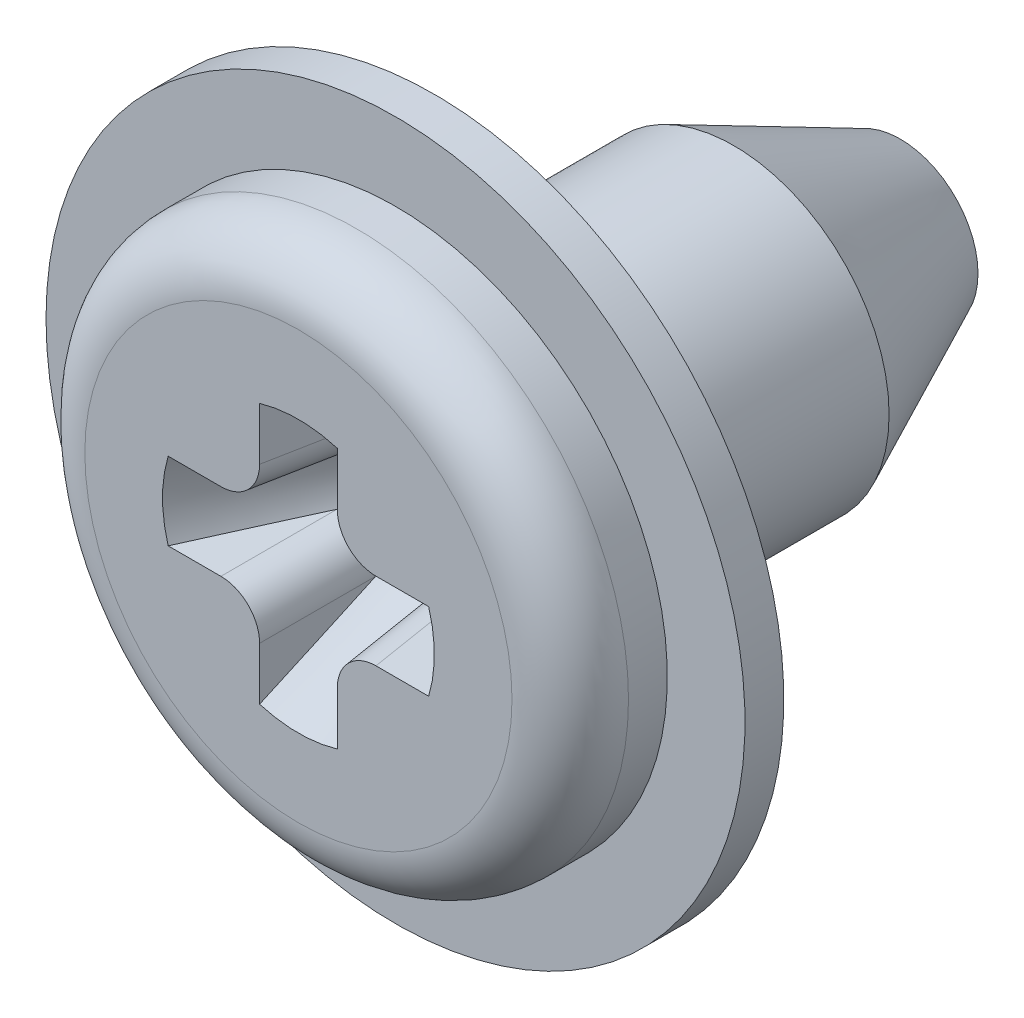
ISO-10303-21;
HEADER;
FILE_DESCRIPTION(('STEP AP214'),'2;1');
FILE_NAME('part.step','',(''),(''),'','','');
FILE_SCHEMA(('AUTOMOTIVE_DESIGN { 1 0 10303 214 1 1 1 1 }'));
ENDSEC;
DATA;
#1=APPLICATION_CONTEXT('core data for automotive mechanical design processes');
#2=APPLICATION_PROTOCOL_DEFINITION('international standard','automotive_design',2000,#1);
#3=PRODUCT_CONTEXT('',#1,'mechanical');
#4=PRODUCT('Part','Part','',(#3));
#5=PRODUCT_RELATED_PRODUCT_CATEGORY('part','',(#4));
#6=PRODUCT_DEFINITION_FORMATION('','',#4);
#7=PRODUCT_DEFINITION_CONTEXT('part definition',#1,'design');
#8=PRODUCT_DEFINITION('design','',#6,#7);
#9=PRODUCT_DEFINITION_SHAPE('','',#8);
#10=(LENGTH_UNIT() NAMED_UNIT(*) SI_UNIT(.MILLI.,.METRE.));
#11=(NAMED_UNIT(*) PLANE_ANGLE_UNIT() SI_UNIT($,.RADIAN.));
#12=(NAMED_UNIT(*) SI_UNIT($,.STERADIAN.) SOLID_ANGLE_UNIT());
#13=UNCERTAINTY_MEASURE_WITH_UNIT(LENGTH_MEASURE(1.E-05),#10,'distance_accuracy_value','');
#14=(GEOMETRIC_REPRESENTATION_CONTEXT(3) GLOBAL_UNCERTAINTY_ASSIGNED_CONTEXT((#13)) GLOBAL_UNIT_ASSIGNED_CONTEXT((#10,
#11,#12)) REPRESENTATION_CONTEXT('',''));
#15=CARTESIAN_POINT('',(0.,0.,0.));
#16=DIRECTION('',(0.,0.,1.));
#17=DIRECTION('',(1.,0.,0.));
#18=AXIS2_PLACEMENT_3D('',#15,#16,#17);
#19=CARTESIAN_POINT('',(0.,0.,7.75));
#20=DIRECTION('',(0.,0.,1.));
#21=DIRECTION('',(1.,0.,0.));
#22=AXIS2_PLACEMENT_3D('',#19,#20,#21);
#23=CONICAL_SURFACE('',#22,1.75,0.5235987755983);
#24=CARTESIAN_POINT('',(0.500017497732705,1.67716625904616,7.7502));
#25=CARTESIAN_POINT('',(0.489050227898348,1.60490105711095,7.6248435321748));
#26=CARTESIAN_POINT('',(0.478085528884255,1.53258418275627,7.49951644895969));
#27=CARTESIAN_POINT('',(0.456166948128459,1.38773778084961,7.24898592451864));
#28=CARTESIAN_POINT('',(0.445213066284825,1.31520825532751,7.12378248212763));
#29=CARTESIAN_POINT('',(0.423321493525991,1.16982525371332,6.87356066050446));
#30=CARTESIAN_POINT('',(0.412383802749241,1.09697177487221,6.74854228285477));
#31=CARTESIAN_POINT('',(0.395999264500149,0.987257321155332,6.56126615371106));
#32=CARTESIAN_POINT('',(0.390541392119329,0.950613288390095,6.49888238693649));
#33=CARTESIAN_POINT('',(0.379636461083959,0.877113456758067,6.37423845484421));
#34=CARTESIAN_POINT('',(0.374189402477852,0.840257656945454,6.3119782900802));
#35=CARTESIAN_POINT('',(0.368749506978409,0.803262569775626,6.2498));
#36=B_SPLINE_CURVE_WITH_KNOTS('',3,(#24,#25,#26,#27,#28,#29,#30,#31,#32,#33,#34,#35),
.UNSPECIFIED.,.F.,.F.,(4,2,2,2,2,4),(0.,0.435328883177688,0.870653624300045,1.30598206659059,
1.52364836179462,1.74131562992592),.UNSPECIFIED.);
#37=CARTESIAN_POINT('',(0.5,1.67705098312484,7.75));
#38=VERTEX_POINT('',#37);
#39=CARTESIAN_POINT('',(0.379752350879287,0.877849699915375,6.37556308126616));
#40=VERTEX_POINT('',#39);
#41=EDGE_CURVE('E150',#38,#40,#36,.T.);
#42=ORIENTED_EDGE('',*,*,#41,.F.);
#43=CARTESIAN_POINT('',(0.,0.,7.75));
#44=DIRECTION('',(0.,0.,1.));
#45=DIRECTION('',(1.,0.,0.));
#46=AXIS2_PLACEMENT_3D('',#43,#44,#45);
#47=CIRCLE('',#46,1.75);
#48=CARTESIAN_POINT('',(-0.5,1.67705098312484,7.75));
#49=VERTEX_POINT('',#48);
#50=EDGE_CURVE('E163',#38,#49,#47,.T.);
#51=ORIENTED_EDGE('',*,*,#50,.T.);
#52=CARTESIAN_POINT('',(-0.368749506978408,0.803262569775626,6.2498));
#53=CARTESIAN_POINT('',(-0.376113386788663,0.853329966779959,6.33396953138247));
#54=CARTESIAN_POINT('',(-0.383489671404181,0.903155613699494,6.41828085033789));
#55=CARTESIAN_POINT('',(-0.398259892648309,1.00246023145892,6.58710525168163));
#56=CARTESIAN_POINT('',(-0.405653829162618,1.05193920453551,6.67161833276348));
#57=CARTESIAN_POINT('',(-0.427851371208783,1.20006129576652,6.92533739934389));
#58=CARTESIAN_POINT('',(-0.44267086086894,1.29839060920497,7.09472494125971));
#59=CARTESIAN_POINT('',(-0.46458277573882,1.44336944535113,7.34517927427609));
#60=CARTESIAN_POINT('',(-0.471667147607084,1.49017956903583,7.42615401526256));
#61=CARTESIAN_POINT('',(-0.485839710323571,1.58372456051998,7.58814714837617));
#62=CARTESIAN_POINT('',(-0.492927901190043,1.63045942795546,7.66916554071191));
#63=CARTESIAN_POINT('',(-0.500017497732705,1.67716625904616,7.7502));
#64=B_SPLINE_CURVE_WITH_KNOTS('',3,(#52,#53,#54,#55,#56,#57,#58,#59,#60,#61,#62,#63),
.UNSPECIFIED.,.F.,.F.,(4,2,2,2,2,4),(0.,0.294632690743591,0.589263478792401,1.17851899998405,
1.45991651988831,1.74131539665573),.UNSPECIFIED.);
#65=CARTESIAN_POINT('',(-0.379752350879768,0.877849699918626,6.37556308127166));
#66=VERTEX_POINT('',#65);
#67=EDGE_CURVE('E170',#66,#49,#64,.T.);
#68=ORIENTED_EDGE('',*,*,#67,.F.);
#69=CARTESIAN_POINT('',(-0.379752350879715,0.877849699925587,6.37556308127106));
#70=CARTESIAN_POINT('',(-0.377885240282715,0.865414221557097,6.35448930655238));
#71=CARTESIAN_POINT('',(-0.376393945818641,0.85282545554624,6.33348883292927));
#72=CARTESIAN_POINT('',(-0.374162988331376,0.827341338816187,6.29163447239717));
#73=CARTESIAN_POINT('',(-0.373423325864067,0.814445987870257,6.27078058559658));
#74=CARTESIAN_POINT('',(-0.373059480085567,0.801397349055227,6.25));
#75=B_SPLINE_CURVE_WITH_KNOTS('',3,(#69,#70,#71,#72,#73,#74),.UNSPECIFIED.,.F.,.F.,(4,2,4),(0.,
0.0735899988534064,0.14718005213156),.UNSPECIFIED.);
#76=CARTESIAN_POINT('',(-0.373059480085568,0.801397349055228,6.25));
#77=VERTEX_POINT('',#76);
#78=EDGE_CURVE('E238',#66,#77,#75,.T.);
#79=ORIENTED_EDGE('',*,*,#78,.T.);
#80=CARTESIAN_POINT('',(0.,0.,6.25));
#81=DIRECTION('',(0.,0.,1.));
#82=DIRECTION('',(1.,0.,0.));
#83=AXIS2_PLACEMENT_3D('',#80,#81,#82);
#84=CIRCLE('',#83,0.88397459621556);
#85=CARTESIAN_POINT('',(0.373059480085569,0.801397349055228,6.25));
#86=VERTEX_POINT('',#85);
#87=EDGE_CURVE('E331',#86,#77,#84,.T.);
#88=ORIENTED_EDGE('',*,*,#87,.F.);
#89=CARTESIAN_POINT('',(0.373059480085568,0.801397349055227,6.25));
#90=CARTESIAN_POINT('',(0.373423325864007,0.814445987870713,6.27078058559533));
#91=CARTESIAN_POINT('',(0.374162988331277,0.827341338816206,6.2916344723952));
#92=CARTESIAN_POINT('',(0.37639394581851,0.852825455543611,6.33348883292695));
#93=CARTESIAN_POINT('',(0.377885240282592,0.865414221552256,6.35448930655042));
#94=CARTESIAN_POINT('',(0.379752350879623,0.877849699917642,6.37556308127));
#95=B_SPLINE_CURVE_WITH_KNOTS('',3,(#89,#90,#91,#92,#93,#94),.UNSPECIFIED.,.F.,.F.,(4,2,4),(0.,
0.0735900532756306,0.14718005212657),.UNSPECIFIED.);
#96=EDGE_CURVE('E270',#86,#40,#95,.T.);
#97=ORIENTED_EDGE('',*,*,#96,.T.);
#98=EDGE_LOOP('',(#42,#51,#68,#79,#88,#97));
#99=FACE_BOUND('',#98,.T.);
#100=ADVANCED_FACE('F29',(#99),#23,.F.);
#101=CARTESIAN_POINT('',(0.803262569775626,0.368749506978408,6.2498));
#102=CARTESIAN_POINT('',(0.85332996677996,0.376113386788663,6.33396953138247));
#103=CARTESIAN_POINT('',(0.903155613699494,0.383489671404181,6.41828085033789));
#104=CARTESIAN_POINT('',(1.00246023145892,0.398259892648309,6.58710525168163));
#105=CARTESIAN_POINT('',(1.05193920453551,0.405653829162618,6.67161833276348));
#106=CARTESIAN_POINT('',(1.20006129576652,0.427851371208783,6.92533739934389));
#107=CARTESIAN_POINT('',(1.29839060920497,0.44267086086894,7.09472494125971));
#108=CARTESIAN_POINT('',(1.44336944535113,0.46458277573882,7.34517927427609));
#109=CARTESIAN_POINT('',(1.49017956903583,0.471667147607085,7.42615401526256));
#110=CARTESIAN_POINT('',(1.58372456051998,0.485839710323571,7.58814714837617));
#111=CARTESIAN_POINT('',(1.63045942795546,0.492927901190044,7.66916554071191));
#112=CARTESIAN_POINT('',(1.67716625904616,0.500017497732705,7.7502));
#113=B_SPLINE_CURVE_WITH_KNOTS('',3,(#101,#102,#103,#104,#105,#106,#107,#108,#109,#110,#111,
#112),.UNSPECIFIED.,.F.,.F.,(4,2,2,2,2,4),(0.,0.294632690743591,0.589263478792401,
1.17851899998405,1.45991651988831,1.74131539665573),.UNSPECIFIED.);
#114=CARTESIAN_POINT('',(0.877849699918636,0.379752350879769,6.37556308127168));
#115=VERTEX_POINT('',#114);
#116=CARTESIAN_POINT('',(1.67705098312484,0.5,7.75));
#117=VERTEX_POINT('',#116);
#118=EDGE_CURVE('E142',#115,#117,#113,.T.);
#119=ORIENTED_EDGE('',*,*,#118,.F.);
#120=CARTESIAN_POINT('',(0.87784969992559,0.379752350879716,6.37556308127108));
#121=CARTESIAN_POINT('',(0.865414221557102,0.377885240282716,6.35448930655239));
#122=CARTESIAN_POINT('',(0.852825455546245,0.376393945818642,6.33348883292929));
#123=CARTESIAN_POINT('',(0.827341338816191,0.374162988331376,6.29163447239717));
#124=CARTESIAN_POINT('',(0.81444598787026,0.373423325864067,6.27078058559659));
#125=CARTESIAN_POINT('',(0.801397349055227,0.373059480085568,6.25));
#126=B_SPLINE_CURVE_WITH_KNOTS('',3,(#120,#121,#122,#123,#124,#125),.UNSPECIFIED.,.F.,.F.,(4,2,
4),(0.,0.0735899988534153,0.147180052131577),.UNSPECIFIED.);
#127=CARTESIAN_POINT('',(0.801397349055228,0.373059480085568,6.25));
#128=VERTEX_POINT('',#127);
#129=EDGE_CURVE('E265',#115,#128,#126,.T.);
#130=ORIENTED_EDGE('',*,*,#129,.T.);
#131=CARTESIAN_POINT('',(0.801397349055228,-0.373059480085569,6.25));
#132=VERTEX_POINT('',#131);
#133=EDGE_CURVE('E44',#132,#128,#84,.T.);
#134=ORIENTED_EDGE('',*,*,#133,.F.);
#135=CARTESIAN_POINT('',(0.801397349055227,-0.373059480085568,6.25));
#136=CARTESIAN_POINT('',(0.814445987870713,-0.373423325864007,6.27078058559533));
#137=CARTESIAN_POINT('',(0.827341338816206,-0.374162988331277,6.2916344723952));
#138=CARTESIAN_POINT('',(0.852825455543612,-0.37639394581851,6.33348883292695));
#139=CARTESIAN_POINT('',(0.865414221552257,-0.377885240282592,6.35448930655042));
#140=CARTESIAN_POINT('',(0.877849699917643,-0.379752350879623,6.37556308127));
#141=B_SPLINE_CURVE_WITH_KNOTS('',3,(#135,#136,#137,#138,#139,#140),.UNSPECIFIED.,.F.,.F.,(4,2,
4),(0.,0.0735900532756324,0.147180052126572),.UNSPECIFIED.);
#142=CARTESIAN_POINT('',(0.877849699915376,-0.379752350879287,6.37556308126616));
#143=VERTEX_POINT('',#142);
#144=EDGE_CURVE('E431',#132,#143,#141,.T.);
#145=ORIENTED_EDGE('',*,*,#144,.T.);
#146=CARTESIAN_POINT('',(1.67716625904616,-0.500017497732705,7.7502));
#147=CARTESIAN_POINT('',(1.60490105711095,-0.489050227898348,7.6248435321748));
#148=CARTESIAN_POINT('',(1.53258418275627,-0.478085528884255,7.49951644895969));
#149=CARTESIAN_POINT('',(1.38773778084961,-0.456166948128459,7.24898592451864));
#150=CARTESIAN_POINT('',(1.31520825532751,-0.445213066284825,7.12378248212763));
#151=CARTESIAN_POINT('',(1.16982525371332,-0.423321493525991,6.87356066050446));
#152=CARTESIAN_POINT('',(1.09697177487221,-0.412383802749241,6.74854228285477));
#153=CARTESIAN_POINT('',(0.987257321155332,-0.395999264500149,6.56126615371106));
#154=CARTESIAN_POINT('',(0.950613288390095,-0.390541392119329,6.49888238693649));
#155=CARTESIAN_POINT('',(0.877113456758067,-0.379636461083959,6.37423845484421));
#156=CARTESIAN_POINT('',(0.840257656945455,-0.374189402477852,6.3119782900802));
#157=CARTESIAN_POINT('',(0.803262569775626,-0.368749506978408,6.2498));
#158=B_SPLINE_CURVE_WITH_KNOTS('',3,(#146,#147,#148,#149,#150,#151,#152,#153,#154,#155,#156,
#157),.UNSPECIFIED.,.F.,.F.,(4,2,2,2,2,4),(0.,0.435328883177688,0.870653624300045,
1.30598206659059,1.52364836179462,1.74131562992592),.UNSPECIFIED.);
#159=CARTESIAN_POINT('',(1.67705098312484,-0.5,7.75));
#160=VERTEX_POINT('',#159);
#161=EDGE_CURVE('E151',#160,#143,#158,.T.);
#162=ORIENTED_EDGE('',*,*,#161,.F.);
#163=EDGE_CURVE('E155',#160,#117,#47,.T.);
#164=ORIENTED_EDGE('',*,*,#163,.T.);
#165=EDGE_LOOP('',(#119,#130,#134,#145,#162,#164));
#166=FACE_BOUND('',#165,.T.);
#167=ADVANCED_FACE('F156',(#166),#23,.F.);
#168=CARTESIAN_POINT('',(0.368749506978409,-0.803262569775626,6.2498));
#169=CARTESIAN_POINT('',(0.376113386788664,-0.853329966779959,6.33396953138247));
#170=CARTESIAN_POINT('',(0.383489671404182,-0.903155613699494,6.41828085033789));
#171=CARTESIAN_POINT('',(0.39825989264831,-1.00246023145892,6.58710525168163));
#172=CARTESIAN_POINT('',(0.405653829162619,-1.05193920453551,6.67161833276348));
#173=CARTESIAN_POINT('',(0.427851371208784,-1.20006129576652,6.92533739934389));
#174=CARTESIAN_POINT('',(0.442670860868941,-1.29839060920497,7.09472494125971));
#175=CARTESIAN_POINT('',(0.464582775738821,-1.44336944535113,7.34517927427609));
#176=CARTESIAN_POINT('',(0.471667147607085,-1.49017956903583,7.42615401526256));
#177=CARTESIAN_POINT('',(0.485839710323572,-1.58372456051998,7.58814714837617));
#178=CARTESIAN_POINT('',(0.492927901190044,-1.63045942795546,7.66916554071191));
#179=CARTESIAN_POINT('',(0.500017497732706,-1.67716625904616,7.7502));
#180=B_SPLINE_CURVE_WITH_KNOTS('',3,(#168,#169,#170,#171,#172,#173,#174,#175,#176,#177,#178,
#179),.UNSPECIFIED.,.F.,.F.,(4,2,2,2,2,4),(0.,0.294632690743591,0.589263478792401,
1.17851899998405,1.45991651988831,1.74131539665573),.UNSPECIFIED.);
#181=CARTESIAN_POINT('',(0.37975235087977,-0.877849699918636,6.37556308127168));
#182=VERTEX_POINT('',#181);
#183=CARTESIAN_POINT('',(0.500000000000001,-1.67705098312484,7.75));
#184=VERTEX_POINT('',#183);
#185=EDGE_CURVE('E358',#182,#184,#180,.T.);
#186=ORIENTED_EDGE('',*,*,#185,.F.);
#187=CARTESIAN_POINT('',(0.379752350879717,-0.87784969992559,6.37556308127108));
#188=CARTESIAN_POINT('',(0.377885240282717,-0.865414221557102,6.35448930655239));
#189=CARTESIAN_POINT('',(0.376393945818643,-0.852825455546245,6.33348883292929));
#190=CARTESIAN_POINT('',(0.374162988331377,-0.82734133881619,6.29163447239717));
#191=CARTESIAN_POINT('',(0.373423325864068,-0.814445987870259,6.27078058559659));
#192=CARTESIAN_POINT('',(0.373059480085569,-0.801397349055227,6.25));
#193=B_SPLINE_CURVE_WITH_KNOTS('',3,(#187,#188,#189,#190,#191,#192),.UNSPECIFIED.,.F.,.F.,(4,2,
4),(0.,0.0735899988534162,0.147180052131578),.UNSPECIFIED.);
#194=CARTESIAN_POINT('',(0.373059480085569,-0.801397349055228,6.25));
#195=VERTEX_POINT('',#194);
#196=EDGE_CURVE('E419',#182,#195,#193,.T.);
#197=ORIENTED_EDGE('',*,*,#196,.T.);
#198=CARTESIAN_POINT('',(-0.373059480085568,-0.801397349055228,6.25));
#199=VERTEX_POINT('',#198);
#200=EDGE_CURVE('E51',#199,#195,#84,.T.);
#201=ORIENTED_EDGE('',*,*,#200,.F.);
#202=CARTESIAN_POINT('',(-0.373059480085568,-0.801397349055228,6.25));
#203=CARTESIAN_POINT('',(-0.373423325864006,-0.814445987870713,6.27078058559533));
#204=CARTESIAN_POINT('',(-0.374162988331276,-0.827341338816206,6.2916344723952));
#205=CARTESIAN_POINT('',(-0.37639394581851,-0.852825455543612,6.33348883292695));
#206=CARTESIAN_POINT('',(-0.377885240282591,-0.865414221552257,6.35448930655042));
#207=CARTESIAN_POINT('',(-0.379752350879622,-0.877849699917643,6.37556308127));
#208=B_SPLINE_CURVE_WITH_KNOTS('',3,(#202,#203,#204,#205,#206,#207),.UNSPECIFIED.,.F.,.F.,(4,2,
4),(0.,0.0735900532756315,0.147180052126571),.UNSPECIFIED.);
#209=CARTESIAN_POINT('',(-0.379752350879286,-0.877849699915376,6.37556308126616));
#210=VERTEX_POINT('',#209);
#211=EDGE_CURVE('E408',#199,#210,#208,.T.);
#212=ORIENTED_EDGE('',*,*,#211,.T.);
#213=CARTESIAN_POINT('',(-0.500017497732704,-1.67716625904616,7.7502));
#214=CARTESIAN_POINT('',(-0.489050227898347,-1.60490105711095,7.6248435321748));
#215=CARTESIAN_POINT('',(-0.478085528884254,-1.53258418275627,7.49951644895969));
#216=CARTESIAN_POINT('',(-0.456166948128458,-1.38773778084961,7.24898592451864));
#217=CARTESIAN_POINT('',(-0.445213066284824,-1.31520825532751,7.12378248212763));
#218=CARTESIAN_POINT('',(-0.42332149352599,-1.16982525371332,6.87356066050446));
#219=CARTESIAN_POINT('',(-0.41238380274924,-1.09697177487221,6.74854228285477));
#220=CARTESIAN_POINT('',(-0.395999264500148,-0.987257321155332,6.56126615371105));
#221=CARTESIAN_POINT('',(-0.390541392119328,-0.950613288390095,6.49888238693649));
#222=CARTESIAN_POINT('',(-0.379636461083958,-0.877113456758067,6.37423845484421));
#223=CARTESIAN_POINT('',(-0.374189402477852,-0.840257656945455,6.3119782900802));
#224=CARTESIAN_POINT('',(-0.368749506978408,-0.803262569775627,6.2498));
#225=B_SPLINE_CURVE_WITH_KNOTS('',3,(#213,#214,#215,#216,#217,#218,#219,#220,#221,#222,#223,
#224),.UNSPECIFIED.,.F.,.F.,(4,2,2,2,2,4),(0.,0.435328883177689,0.870653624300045,
1.30598206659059,1.52364836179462,1.74131562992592),.UNSPECIFIED.);
#226=CARTESIAN_POINT('',(-0.499999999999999,-1.67705098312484,7.75));
#227=VERTEX_POINT('',#226);
#228=EDGE_CURVE('E363',#227,#210,#225,.T.);
#229=ORIENTED_EDGE('',*,*,#228,.F.);
#230=EDGE_CURVE('E160',#227,#184,#47,.T.);
#231=ORIENTED_EDGE('',*,*,#230,.T.);
#232=EDGE_LOOP('',(#186,#197,#201,#212,#229,#231));
#233=FACE_BOUND('',#232,.T.);
#234=ADVANCED_FACE('F387',(#233),#23,.F.);
#235=CARTESIAN_POINT('',(-0.803262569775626,-0.368749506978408,6.2498));
#236=CARTESIAN_POINT('',(-0.853329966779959,-0.376113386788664,6.33396953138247));
#237=CARTESIAN_POINT('',(-0.903155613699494,-0.383489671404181,6.41828085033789));
#238=CARTESIAN_POINT('',(-1.00246023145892,-0.39825989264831,6.58710525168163));
#239=CARTESIAN_POINT('',(-1.05193920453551,-0.405653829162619,6.67161833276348));
#240=CARTESIAN_POINT('',(-1.20006129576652,-0.427851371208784,6.92533739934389));
#241=CARTESIAN_POINT('',(-1.29839060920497,-0.442670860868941,7.09472494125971));
#242=CARTESIAN_POINT('',(-1.44336944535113,-0.46458277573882,7.34517927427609));
#243=CARTESIAN_POINT('',(-1.49017956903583,-0.471667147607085,7.42615401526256));
#244=CARTESIAN_POINT('',(-1.58372456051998,-0.485839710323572,7.58814714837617));
#245=CARTESIAN_POINT('',(-1.63045942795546,-0.492927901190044,7.66916554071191));
#246=CARTESIAN_POINT('',(-1.67716625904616,-0.500017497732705,7.7502));
#247=B_SPLINE_CURVE_WITH_KNOTS('',3,(#235,#236,#237,#238,#239,#240,#241,#242,#243,#244,#245,
#246),.UNSPECIFIED.,.F.,.F.,(4,2,2,2,2,4),(0.,0.294632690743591,0.589263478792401,
1.17851899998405,1.45991651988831,1.74131539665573),.UNSPECIFIED.);
#248=CARTESIAN_POINT('',(-0.877849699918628,-0.379752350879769,6.37556308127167));
#249=VERTEX_POINT('',#248);
#250=CARTESIAN_POINT('',(-1.67705098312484,-0.5,7.75));
#251=VERTEX_POINT('',#250);
#252=EDGE_CURVE('E368',#249,#251,#247,.T.);
#253=ORIENTED_EDGE('',*,*,#252,.F.);
#254=CARTESIAN_POINT('',(-0.877849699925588,-0.379752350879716,6.37556308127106));
#255=CARTESIAN_POINT('',(-0.865414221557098,-0.377885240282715,6.35448930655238));
#256=CARTESIAN_POINT('',(-0.852825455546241,-0.376393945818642,6.33348883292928));
#257=CARTESIAN_POINT('',(-0.827341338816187,-0.374162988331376,6.29163447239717));
#258=CARTESIAN_POINT('',(-0.814445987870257,-0.373423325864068,6.27078058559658));
#259=CARTESIAN_POINT('',(-0.801397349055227,-0.373059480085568,6.25));
#260=B_SPLINE_CURVE_WITH_KNOTS('',3,(#254,#255,#256,#257,#258,#259),.UNSPECIFIED.,.F.,.F.,(4,2,
4),(0.,0.0735899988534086,0.147180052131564),.UNSPECIFIED.);
#261=CARTESIAN_POINT('',(-0.801397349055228,-0.373059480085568,6.25));
#262=VERTEX_POINT('',#261);
#263=EDGE_CURVE('E398',#249,#262,#260,.T.);
#264=ORIENTED_EDGE('',*,*,#263,.T.);
#265=CARTESIAN_POINT('',(-0.801397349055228,0.373059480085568,6.25));
#266=VERTEX_POINT('',#265);
#267=EDGE_CURVE('E636',#266,#262,#84,.T.);
#268=ORIENTED_EDGE('',*,*,#267,.F.);
#269=CARTESIAN_POINT('',(-0.801397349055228,0.373059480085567,6.25));
#270=CARTESIAN_POINT('',(-0.814445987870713,0.373423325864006,6.27078058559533));
#271=CARTESIAN_POINT('',(-0.827341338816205,0.374162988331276,6.2916344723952));
#272=CARTESIAN_POINT('',(-0.85282545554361,0.376393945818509,6.33348883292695));
#273=CARTESIAN_POINT('',(-0.865414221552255,0.377885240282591,6.35448930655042));
#274=CARTESIAN_POINT('',(-0.87784969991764,0.379752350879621,6.37556308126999));
#275=B_SPLINE_CURVE_WITH_KNOTS('',3,(#269,#270,#271,#272,#273,#274),.UNSPECIFIED.,.F.,.F.,(4,2,
4),(0.,0.0735900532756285,0.147180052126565),.UNSPECIFIED.);
#276=CARTESIAN_POINT('',(-0.877849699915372,0.379752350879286,6.37556308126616));
#277=VERTEX_POINT('',#276);
#278=EDGE_CURVE('E237',#266,#277,#275,.T.);
#279=ORIENTED_EDGE('',*,*,#278,.T.);
#280=CARTESIAN_POINT('',(-1.67716625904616,0.500017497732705,7.7502));
#281=CARTESIAN_POINT('',(-1.60490105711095,0.489050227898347,7.6248435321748));
#282=CARTESIAN_POINT('',(-1.53258418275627,0.478085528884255,7.49951644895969));
#283=CARTESIAN_POINT('',(-1.38773778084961,0.456166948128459,7.24898592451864));
#284=CARTESIAN_POINT('',(-1.31520825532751,0.445213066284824,7.12378248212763));
#285=CARTESIAN_POINT('',(-1.16982525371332,0.42332149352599,6.87356066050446));
#286=CARTESIAN_POINT('',(-1.09697177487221,0.41238380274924,6.74854228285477));
#287=CARTESIAN_POINT('',(-0.987257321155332,0.395999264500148,6.56126615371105));
#288=CARTESIAN_POINT('',(-0.950613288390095,0.390541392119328,6.49888238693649));
#289=CARTESIAN_POINT('',(-0.877113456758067,0.379636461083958,6.37423845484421));
#290=CARTESIAN_POINT('',(-0.840257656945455,0.374189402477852,6.3119782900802));
#291=CARTESIAN_POINT('',(-0.803262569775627,0.368749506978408,6.2498));
#292=B_SPLINE_CURVE_WITH_KNOTS('',3,(#280,#281,#282,#283,#284,#285,#286,#287,#288,#289,#290,
#291),.UNSPECIFIED.,.F.,.F.,(4,2,2,2,2,4),(0.,0.435328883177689,0.870653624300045,
1.30598206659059,1.52364836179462,1.74131562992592),.UNSPECIFIED.);
#293=CARTESIAN_POINT('',(-1.67705098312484,0.499999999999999,7.75));
#294=VERTEX_POINT('',#293);
#295=EDGE_CURVE('E182',#294,#277,#292,.T.);
#296=ORIENTED_EDGE('',*,*,#295,.F.);
#297=EDGE_CURVE('E402',#294,#251,#47,.T.);
#298=ORIENTED_EDGE('',*,*,#297,.T.);
#299=EDGE_LOOP('',(#253,#264,#268,#279,#296,#298));
#300=FACE_BOUND('',#299,.T.);
#301=ADVANCED_FACE('F206',(#300),#23,.F.);
#302=CARTESIAN_POINT('',(0.,0.,6.25));
#303=DIRECTION('',(0.,0.,1.));
#304=DIRECTION('',(1.,0.,0.));
#305=AXIS2_PLACEMENT_3D('',#302,#303,#304);
#306=CONICAL_SURFACE('',#305,0.88397459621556,0.78539816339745);
#307=CARTESIAN_POINT('',(0.,0.,5.4));
#308=DIRECTION('',(0.,0.,1.));
#309=DIRECTION('',(1.,0.,0.));
#310=AXIS2_PLACEMENT_3D('',#307,#308,#309);
#311=CIRCLE('',#310,0.0339745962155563);
#312=CARTESIAN_POINT('',(0.0339745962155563,0.,5.4));
#313=VERTEX_POINT('',#312);
#314=EDGE_CURVE('E161',#313,#313,#311,.T.);
#315=ORIENTED_EDGE('',*,*,#314,.F.);
#316=EDGE_LOOP('',(#315));
#317=FACE_BOUND('',#316,.T.);
#318=ORIENTED_EDGE('',*,*,#133,.T.);
#319=CARTESIAN_POINT('',(0.801397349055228,0.373059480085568,6.25));
#320=CARTESIAN_POINT('',(0.789872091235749,0.373567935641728,6.23976776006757));
#321=CARTESIAN_POINT('',(0.778264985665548,0.374440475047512,6.22965854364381));
#322=CARTESIAN_POINT('',(0.754821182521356,0.377011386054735,6.20973906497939));
#323=CARTESIAN_POINT('',(0.742983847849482,0.37871250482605,6.19992991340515));
#324=CARTESIAN_POINT('',(0.706721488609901,0.385274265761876,6.17079540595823));
#325=CARTESIAN_POINT('',(0.681952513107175,0.391582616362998,6.15213208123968));
#326=CARTESIAN_POINT('',(0.643857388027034,0.405015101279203,6.12660359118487));
#327=CARTESIAN_POINT('',(0.630779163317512,0.410275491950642,6.11839210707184));
#328=CARTESIAN_POINT('',(0.604573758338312,0.422395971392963,6.10343674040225));
#329=CARTESIAN_POINT('',(0.591447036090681,0.429249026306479,6.09668664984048));
#330=CARTESIAN_POINT('',(0.567598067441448,0.443443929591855,6.08621647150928));
#331=CARTESIAN_POINT('',(0.556850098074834,0.450499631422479,6.08217508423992));
#332=CARTESIAN_POINT('',(0.535744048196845,0.465890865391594,6.07589588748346));
#333=CARTESIAN_POINT('',(0.52538556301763,0.474225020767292,6.07365615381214));
#334=CARTESIAN_POINT('',(0.505360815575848,0.492087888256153,6.07126362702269));
#335=CARTESIAN_POINT('',(0.495699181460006,0.501623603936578,6.07112369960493));
#336=CARTESIAN_POINT('',(0.477489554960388,0.521514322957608,6.07298501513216));
#337=CARTESIAN_POINT('',(0.468942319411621,0.531869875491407,6.07498770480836));
#338=CARTESIAN_POINT('',(0.451950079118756,0.554605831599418,6.08130617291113));
#339=CARTESIAN_POINT('',(0.443714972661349,0.567056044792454,6.08592529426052));
#340=CARTESIAN_POINT('',(0.428911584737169,0.592109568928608,6.09703627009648));
#341=CARTESIAN_POINT('',(0.422347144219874,0.60471316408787,6.10353236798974));
#342=CARTESIAN_POINT('',(0.406963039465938,0.637886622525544,6.1224225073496));
#343=CARTESIAN_POINT('',(0.399391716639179,0.658388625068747,6.13592929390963));
#344=CARTESIAN_POINT('',(0.387317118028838,0.698890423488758,6.16491634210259));
#345=CARTESIAN_POINT('',(0.38282350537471,0.718888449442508,6.180402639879));
#346=CARTESIAN_POINT('',(0.377799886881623,0.749267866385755,6.2051290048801));
#347=CARTESIAN_POINT('',(0.376397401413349,0.759844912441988,6.21396870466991));
#348=CARTESIAN_POINT('',(0.374255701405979,0.780770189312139,6.23184257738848));
#349=CARTESIAN_POINT('',(0.373511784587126,0.79111951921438,6.24087489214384));
#350=CARTESIAN_POINT('',(0.373059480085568,0.801397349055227,6.25));
#351=B_SPLINE_CURVE_WITH_KNOTS('',3,(#319,#320,#321,#322,#323,#324,#325,#326,#327,#328,#329,
#330,#331,#332,#333,#334,#335,#336,#337,#338,#339,#340,#341,#342,#343,#344,#345,#346,#347,#348,
#349,#350),.UNSPECIFIED.,.F.,.F.,(4,2,2,2,2,2,2,2,2,2,2,2,2,2,2,4),(0.,0.0462354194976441,
0.0926251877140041,0.187043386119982,0.235884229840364,0.284513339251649,0.324789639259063,
0.365022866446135,0.405502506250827,0.446009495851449,0.49262663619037,0.539350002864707,
0.615998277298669,0.692886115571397,0.734436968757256,0.775688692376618),.UNSPECIFIED.);
#352=EDGE_CURVE('E221',#128,#86,#351,.T.);
#353=ORIENTED_EDGE('',*,*,#352,.T.);
#354=ORIENTED_EDGE('',*,*,#87,.T.);
#355=CARTESIAN_POINT('',(-0.373059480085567,0.801397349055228,6.25));
#356=CARTESIAN_POINT('',(-0.373567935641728,0.78987209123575,6.23976776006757));
#357=CARTESIAN_POINT('',(-0.374440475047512,0.778264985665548,6.22965854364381));
#358=CARTESIAN_POINT('',(-0.377011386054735,0.754821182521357,6.20973906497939));
#359=CARTESIAN_POINT('',(-0.378712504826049,0.742983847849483,6.19992991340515));
#360=CARTESIAN_POINT('',(-0.385274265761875,0.706721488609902,6.17079540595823));
#361=CARTESIAN_POINT('',(-0.391582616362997,0.681952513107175,6.15213208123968));
#362=CARTESIAN_POINT('',(-0.405015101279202,0.643857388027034,6.12660359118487));
#363=CARTESIAN_POINT('',(-0.410275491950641,0.630779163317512,6.11839210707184));
#364=CARTESIAN_POINT('',(-0.422395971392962,0.604573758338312,6.10343674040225));
#365=CARTESIAN_POINT('',(-0.429249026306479,0.591447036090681,6.09668664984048));
#366=CARTESIAN_POINT('',(-0.443443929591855,0.567598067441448,6.08621647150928));
#367=CARTESIAN_POINT('',(-0.450499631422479,0.556850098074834,6.08217508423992));
#368=CARTESIAN_POINT('',(-0.465890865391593,0.535744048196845,6.07589588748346));
#369=CARTESIAN_POINT('',(-0.474225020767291,0.52538556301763,6.07365615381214));
#370=CARTESIAN_POINT('',(-0.492087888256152,0.505360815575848,6.07126362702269));
#371=CARTESIAN_POINT('',(-0.501623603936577,0.495699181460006,6.07112369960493));
#372=CARTESIAN_POINT('',(-0.521514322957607,0.477489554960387,6.07298501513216));
#373=CARTESIAN_POINT('',(-0.531869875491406,0.468942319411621,6.07498770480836));
#374=CARTESIAN_POINT('',(-0.554605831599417,0.451950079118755,6.08130617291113));
#375=CARTESIAN_POINT('',(-0.567056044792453,0.443714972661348,6.08592529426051));
#376=CARTESIAN_POINT('',(-0.592109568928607,0.428911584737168,6.09703627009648));
#377=CARTESIAN_POINT('',(-0.604713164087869,0.422347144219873,6.10353236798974));
#378=CARTESIAN_POINT('',(-0.637886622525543,0.406963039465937,6.1224225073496));
#379=CARTESIAN_POINT('',(-0.658388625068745,0.399391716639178,6.13592929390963));
#380=CARTESIAN_POINT('',(-0.698890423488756,0.387317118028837,6.16491634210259));
#381=CARTESIAN_POINT('',(-0.718888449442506,0.38282350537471,6.180402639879));
#382=CARTESIAN_POINT('',(-0.749267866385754,0.377799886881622,6.20512900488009));
#383=CARTESIAN_POINT('',(-0.759844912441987,0.376397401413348,6.21396870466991));
#384=CARTESIAN_POINT('',(-0.780770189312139,0.374255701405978,6.23184257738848));
#385=CARTESIAN_POINT('',(-0.79111951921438,0.373511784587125,6.24087489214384));
#386=CARTESIAN_POINT('',(-0.801397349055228,0.373059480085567,6.25));
#387=B_SPLINE_CURVE_WITH_KNOTS('',3,(#355,#356,#357,#358,#359,#360,#361,#362,#363,#364,#365,
#366,#367,#368,#369,#370,#371,#372,#373,#374,#375,#376,#377,#378,#379,#380,#381,#382,#383,#384,
#385,#386),.UNSPECIFIED.,.F.,.F.,(4,2,2,2,2,2,2,2,2,2,2,2,2,2,2,4),(0.,0.0462354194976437,
0.0926251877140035,0.187043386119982,0.235884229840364,0.284513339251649,0.324789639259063,
0.365022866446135,0.405502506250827,0.446009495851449,0.49262663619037,0.539350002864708,
0.615998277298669,0.692886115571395,0.734436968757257,0.77568869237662),.UNSPECIFIED.);
#388=EDGE_CURVE('E229',#77,#266,#387,.T.);
#389=ORIENTED_EDGE('',*,*,#388,.T.);
#390=ORIENTED_EDGE('',*,*,#267,.T.);
#391=CARTESIAN_POINT('',(-0.801397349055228,-0.373059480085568,6.25));
#392=CARTESIAN_POINT('',(-0.78987209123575,-0.373567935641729,6.23976776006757));
#393=CARTESIAN_POINT('',(-0.778264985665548,-0.374440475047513,6.22965854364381));
#394=CARTESIAN_POINT('',(-0.754821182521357,-0.377011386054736,6.20973906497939));
#395=CARTESIAN_POINT('',(-0.742983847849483,-0.37871250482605,6.19992991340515));
#396=CARTESIAN_POINT('',(-0.706721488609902,-0.385274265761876,6.17079540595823));
#397=CARTESIAN_POINT('',(-0.681952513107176,-0.391582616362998,6.15213208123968));
#398=CARTESIAN_POINT('',(-0.643857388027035,-0.405015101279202,6.12660359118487));
#399=CARTESIAN_POINT('',(-0.630779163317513,-0.410275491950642,6.11839210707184));
#400=CARTESIAN_POINT('',(-0.604573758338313,-0.422395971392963,6.10343674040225));
#401=CARTESIAN_POINT('',(-0.591447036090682,-0.429249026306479,6.09668664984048));
#402=CARTESIAN_POINT('',(-0.567598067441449,-0.443443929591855,6.08621647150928));
#403=CARTESIAN_POINT('',(-0.556850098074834,-0.450499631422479,6.08217508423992));
#404=CARTESIAN_POINT('',(-0.535744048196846,-0.465890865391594,6.07589588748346));
#405=CARTESIAN_POINT('',(-0.52538556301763,-0.474225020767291,6.07365615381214));
#406=CARTESIAN_POINT('',(-0.505360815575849,-0.492087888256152,6.07126362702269));
#407=CARTESIAN_POINT('',(-0.495699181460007,-0.501623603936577,6.07112369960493));
#408=CARTESIAN_POINT('',(-0.477489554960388,-0.521514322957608,6.07298501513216));
#409=CARTESIAN_POINT('',(-0.468942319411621,-0.531869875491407,6.07498770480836));
#410=CARTESIAN_POINT('',(-0.451950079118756,-0.554605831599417,6.08130617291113));
#411=CARTESIAN_POINT('',(-0.443714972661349,-0.567056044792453,6.08592529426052));
#412=CARTESIAN_POINT('',(-0.428911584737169,-0.592109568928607,6.09703627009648));
#413=CARTESIAN_POINT('',(-0.422347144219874,-0.604713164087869,6.10353236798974));
#414=CARTESIAN_POINT('',(-0.406963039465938,-0.637886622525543,6.1224225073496));
#415=CARTESIAN_POINT('',(-0.399391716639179,-0.658388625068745,6.13592929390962));
#416=CARTESIAN_POINT('',(-0.387317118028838,-0.698890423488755,6.16491634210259));
#417=CARTESIAN_POINT('',(-0.38282350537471,-0.718888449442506,6.180402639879));
#418=CARTESIAN_POINT('',(-0.377799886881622,-0.749267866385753,6.20512900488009));
#419=CARTESIAN_POINT('',(-0.376397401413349,-0.759844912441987,6.21396870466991));
#420=CARTESIAN_POINT('',(-0.374255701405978,-0.780770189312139,6.23184257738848));
#421=CARTESIAN_POINT('',(-0.373511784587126,-0.79111951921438,6.24087489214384));
#422=CARTESIAN_POINT('',(-0.373059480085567,-0.801397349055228,6.25));
#423=B_SPLINE_CURVE_WITH_KNOTS('',3,(#391,#392,#393,#394,#395,#396,#397,#398,#399,#400,#401,
#402,#403,#404,#405,#406,#407,#408,#409,#410,#411,#412,#413,#414,#415,#416,#417,#418,#419,#420,
#421,#422),.UNSPECIFIED.,.F.,.F.,(4,2,2,2,2,2,2,2,2,2,2,2,2,2,2,4),(0.,0.0462354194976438,
0.0926251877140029,0.18704338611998,0.235884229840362,0.284513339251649,0.324789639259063,
0.365022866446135,0.405502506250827,0.446009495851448,0.492626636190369,0.539350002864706,
0.615998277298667,0.692886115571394,0.734436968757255,0.775688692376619),.UNSPECIFIED.);
#424=EDGE_CURVE('E407',#262,#199,#423,.T.);
#425=ORIENTED_EDGE('',*,*,#424,.T.);
#426=ORIENTED_EDGE('',*,*,#200,.T.);
#427=CARTESIAN_POINT('',(0.373059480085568,-0.801397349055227,6.25));
#428=CARTESIAN_POINT('',(0.373567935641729,-0.789872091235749,6.23976776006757));
#429=CARTESIAN_POINT('',(0.374440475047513,-0.778264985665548,6.22965854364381));
#430=CARTESIAN_POINT('',(0.377011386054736,-0.754821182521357,6.20973906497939));
#431=CARTESIAN_POINT('',(0.37871250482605,-0.742983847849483,6.19992991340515));
#432=CARTESIAN_POINT('',(0.385274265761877,-0.706721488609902,6.17079540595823));
#433=CARTESIAN_POINT('',(0.391582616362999,-0.681952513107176,6.15213208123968));
#434=CARTESIAN_POINT('',(0.405015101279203,-0.643857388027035,6.12660359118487));
#435=CARTESIAN_POINT('',(0.410275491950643,-0.630779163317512,6.11839210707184));
#436=CARTESIAN_POINT('',(0.422395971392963,-0.604573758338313,6.10343674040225));
#437=CARTESIAN_POINT('',(0.42924902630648,-0.591447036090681,6.09668664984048));
#438=CARTESIAN_POINT('',(0.443443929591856,-0.567598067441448,6.08621647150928));
#439=CARTESIAN_POINT('',(0.45049963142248,-0.556850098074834,6.08217508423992));
#440=CARTESIAN_POINT('',(0.465890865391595,-0.535744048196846,6.07589588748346));
#441=CARTESIAN_POINT('',(0.474225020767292,-0.52538556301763,6.07365615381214));
#442=CARTESIAN_POINT('',(0.492087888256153,-0.505360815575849,6.07126362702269));
#443=CARTESIAN_POINT('',(0.501623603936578,-0.495699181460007,6.07112369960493));
#444=CARTESIAN_POINT('',(0.521514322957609,-0.477489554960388,6.07298501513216));
#445=CARTESIAN_POINT('',(0.531869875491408,-0.468942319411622,6.07498770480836));
#446=CARTESIAN_POINT('',(0.554605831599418,-0.451950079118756,6.08130617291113));
#447=CARTESIAN_POINT('',(0.567056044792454,-0.443714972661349,6.08592529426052));
#448=CARTESIAN_POINT('',(0.592109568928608,-0.428911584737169,6.09703627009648));
#449=CARTESIAN_POINT('',(0.60471316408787,-0.422347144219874,6.10353236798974));
#450=CARTESIAN_POINT('',(0.637886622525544,-0.406963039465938,6.1224225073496));
#451=CARTESIAN_POINT('',(0.658388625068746,-0.399391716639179,6.13592929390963));
#452=CARTESIAN_POINT('',(0.698890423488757,-0.387317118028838,6.16491634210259));
#453=CARTESIAN_POINT('',(0.718888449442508,-0.382823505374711,6.180402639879));
#454=CARTESIAN_POINT('',(0.749267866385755,-0.377799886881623,6.2051290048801));
#455=CARTESIAN_POINT('',(0.759844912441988,-0.37639740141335,6.21396870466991));
#456=CARTESIAN_POINT('',(0.780770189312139,-0.374255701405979,6.23184257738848));
#457=CARTESIAN_POINT('',(0.79111951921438,-0.373511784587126,6.24087489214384));
#458=CARTESIAN_POINT('',(0.801397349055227,-0.373059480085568,6.25));
#459=B_SPLINE_CURVE_WITH_KNOTS('',3,(#427,#428,#429,#430,#431,#432,#433,#434,#435,#436,#437,
#438,#439,#440,#441,#442,#443,#444,#445,#446,#447,#448,#449,#450,#451,#452,#453,#454,#455,#456,
#457,#458),.UNSPECIFIED.,.F.,.F.,(4,2,2,2,2,2,2,2,2,2,2,2,2,2,2,4),(0.,0.0462354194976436,
0.0926251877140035,0.18704338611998,0.235884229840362,0.284513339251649,0.324789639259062,
0.365022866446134,0.405502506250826,0.446009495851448,0.492626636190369,0.539350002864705,
0.615998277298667,0.692886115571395,0.734436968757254,0.775688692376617),.UNSPECIFIED.);
#460=EDGE_CURVE('E211',#195,#132,#459,.T.);
#461=ORIENTED_EDGE('',*,*,#460,.T.);
#462=EDGE_LOOP('',(#318,#353,#354,#389,#390,#425,#426,#461));
#463=FACE_BOUND('',#462,.T.);
#464=ADVANCED_FACE('F203',(#317,#463),#306,.F.);
#465=CARTESIAN_POINT('',(0.,0.,6.));
#466=DIRECTION('',(0.,0.,-1.));
#467=DIRECTION('',(-1.,0.,0.));
#468=AXIS2_PLACEMENT_3D('',#465,#466,#467);
#469=CYLINDRICAL_SURFACE('',#468,2.);
#470=CARTESIAN_POINT('',(0.,0.,2.14450692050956));
#471=DIRECTION('',(0.,0.,1.));
#472=DIRECTION('',(1.,0.,0.));
#473=AXIS2_PLACEMENT_3D('',#470,#471,#472);
#474=CIRCLE('',#473,2.);
#475=CARTESIAN_POINT('',(2.,0.,2.14450692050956));
#476=VERTEX_POINT('',#475);
#477=EDGE_CURVE('E317',#476,#476,#474,.T.);
#478=ORIENTED_EDGE('',*,*,#477,.T.);
#479=EDGE_LOOP('',(#478));
#480=FACE_BOUND('',#479,.T.);
#481=CARTESIAN_POINT('',(0.,0.,6.));
#482=DIRECTION('',(0.,0.,1.));
#483=DIRECTION('',(1.,0.,0.));
#484=AXIS2_PLACEMENT_3D('',#481,#482,#483);
#485=CIRCLE('',#484,2.);
#486=CARTESIAN_POINT('',(2.,0.,6.));
#487=VERTEX_POINT('',#486);
#488=EDGE_CURVE('E320',#487,#487,#485,.T.);
#489=ORIENTED_EDGE('',*,*,#488,.F.);
#490=EDGE_LOOP('',(#489));
#491=FACE_BOUND('',#490,.T.);
#492=ADVANCED_FACE('F31',(#480,#491),#469,.T.);
#493=CARTESIAN_POINT('',(0.,0.,0.));
#494=DIRECTION('',(0.,0.,1.));
#495=DIRECTION('',(1.,0.,0.));
#496=AXIS2_PLACEMENT_3D('',#493,#494,#495);
#497=PLANE('',#496);
#498=CARTESIAN_POINT('',(0.,0.,0.));
#499=DIRECTION('',(0.,0.,1.));
#500=DIRECTION('',(1.,0.,0.));
#501=AXIS2_PLACEMENT_3D('',#498,#499,#500);
#502=CIRCLE('',#501,0.999999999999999);
#503=CARTESIAN_POINT('',(0.999999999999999,0.,0.));
#504=VERTEX_POINT('',#503);
#505=EDGE_CURVE('E314',#504,#504,#502,.F.);
#506=ORIENTED_EDGE('',*,*,#505,.T.);
#507=EDGE_LOOP('',(#506));
#508=FACE_BOUND('',#507,.T.);
#509=ADVANCED_FACE('F468',(#508),#497,.F.);
#510=CARTESIAN_POINT('',(0.,0.,6.));
#511=DIRECTION('',(0.,0.,1.));
#512=DIRECTION('',(1.,0.,0.));
#513=AXIS2_PLACEMENT_3D('',#510,#511,#512);
#514=PLANE('',#513);
#515=CARTESIAN_POINT('',(0.,0.,6.));
#516=DIRECTION('',(0.,0.,-1.));
#517=DIRECTION('',(-1.,0.,0.));
#518=AXIS2_PLACEMENT_3D('',#515,#516,#517);
#519=CIRCLE('',#518,4.5);
#520=CARTESIAN_POINT('',(-4.5,0.,6.));
#521=VERTEX_POINT('',#520);
#522=EDGE_CURVE('E326',#521,#521,#519,.T.);
#523=ORIENTED_EDGE('',*,*,#522,.T.);
#524=EDGE_LOOP('',(#523));
#525=FACE_BOUND('',#524,.T.);
#526=ORIENTED_EDGE('',*,*,#488,.T.);
#527=EDGE_LOOP('',(#526));
#528=FACE_BOUND('',#527,.T.);
#529=ADVANCED_FACE('F461',(#525,#528),#514,.F.);
#530=CARTESIAN_POINT('',(0.,0.,2.14450692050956));
#531=DIRECTION('',(0.,0.,1.));
#532=DIRECTION('',(1.,0.,0.));
#533=AXIS2_PLACEMENT_3D('',#530,#531,#532);
#534=CONICAL_SURFACE('',#533,2.,0.436332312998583);
#535=ORIENTED_EDGE('',*,*,#505,.F.);
#536=EDGE_LOOP('',(#535));
#537=FACE_BOUND('',#536,.T.);
#538=ORIENTED_EDGE('',*,*,#477,.F.);
#539=EDGE_LOOP('',(#538));
#540=FACE_BOUND('',#539,.T.);
#541=ADVANCED_FACE('F453',(#537,#540),#534,.T.);
#542=CARTESIAN_POINT('',(0.,0.,6.5));
#543=DIRECTION('',(0.,0.,-1.));
#544=DIRECTION('',(-1.,0.,0.));
#545=AXIS2_PLACEMENT_3D('',#542,#543,#544);
#546=PLANE('',#545);
#547=CARTESIAN_POINT('',(0.,0.,6.5));
#548=DIRECTION('',(0.,0.,-1.));
#549=DIRECTION('',(-1.,0.,0.));
#550=AXIS2_PLACEMENT_3D('',#547,#548,#549);
#551=CIRCLE('',#550,4.5);
#552=CARTESIAN_POINT('',(-4.5,0.,6.5));
#553=VERTEX_POINT('',#552);
#554=EDGE_CURVE('E323',#553,#553,#551,.T.);
#555=ORIENTED_EDGE('',*,*,#554,.F.);
#556=EDGE_LOOP('',(#555));
#557=FACE_BOUND('',#556,.T.);
#558=CARTESIAN_POINT('',(0.,0.,6.5));
#559=DIRECTION('',(0.,0.,-1.));
#560=DIRECTION('',(-1.,0.,0.));
#561=AXIS2_PLACEMENT_3D('',#558,#559,#560);
#562=CIRCLE('',#561,3.5);
#563=CARTESIAN_POINT('',(-3.5,0.,6.5));
#564=VERTEX_POINT('',#563);
#565=EDGE_CURVE('E311',#564,#564,#562,.T.);
#566=ORIENTED_EDGE('',*,*,#565,.T.);
#567=EDGE_LOOP('',(#566));
#568=FACE_BOUND('',#567,.T.);
#569=ADVANCED_FACE('F450',(#557,#568),#546,.F.);
#570=CARTESIAN_POINT('',(0.,0.,6.5));
#571=DIRECTION('',(0.,0.,-1.));
#572=DIRECTION('',(-1.,0.,0.));
#573=AXIS2_PLACEMENT_3D('',#570,#571,#572);
#574=CYLINDRICAL_SURFACE('',#573,4.5);
#575=ORIENTED_EDGE('',*,*,#554,.T.);
#576=EDGE_LOOP('',(#575));
#577=FACE_BOUND('',#576,.T.);
#578=ORIENTED_EDGE('',*,*,#522,.F.);
#579=EDGE_LOOP('',(#578));
#580=FACE_BOUND('',#579,.T.);
#581=ADVANCED_FACE('F452',(#577,#580),#574,.T.);
#582=CARTESIAN_POINT('',(0.,0.,7.75));
#583=DIRECTION('',(0.,0.,1.));
#584=DIRECTION('',(1.,0.,0.));
#585=AXIS2_PLACEMENT_3D('',#582,#583,#584);
#586=PLANE('',#585);
#587=CARTESIAN_POINT('',(0.,0.,7.75));
#588=DIRECTION('',(0.,0.,1.));
#589=DIRECTION('',(1.,0.,0.));
#590=AXIS2_PLACEMENT_3D('',#587,#588,#589);
#591=CIRCLE('',#590,2.75);
#592=CARTESIAN_POINT('',(2.75,0.,7.75));
#593=VERTEX_POINT('',#592);
#594=EDGE_CURVE('E37',#593,#593,#591,.T.);
#595=ORIENTED_EDGE('',*,*,#594,.T.);
#596=EDGE_LOOP('',(#595));
#597=FACE_BOUND('',#596,.T.);
#598=DIRECTION('',(0.,1.,0.));
#599=VECTOR('',#598,1.);
#600=CARTESIAN_POINT('',(0.5,2.,7.75));
#601=LINE('',#600,#599);
#602=CARTESIAN_POINT('',(0.5,0.998097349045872,7.75));
#603=VERTEX_POINT('',#602);
#604=EDGE_CURVE('E167',#603,#38,#601,.T.);
#605=ORIENTED_EDGE('',*,*,#604,.F.);
#606=CARTESIAN_POINT('',(1.00190991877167,1.00190991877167,7.75));
#607=DIRECTION('',(0.,0.,1.));
#608=DIRECTION('',(0.707106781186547,0.707106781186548,0.));
#609=AXIS2_PLACEMENT_3D('',#606,#607,#608);
#610=ELLIPSE('',#609,0.503812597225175,0.5);
#611=CARTESIAN_POINT('',(0.998097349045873,0.499999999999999,7.75));
#612=VERTEX_POINT('',#611);
#613=EDGE_CURVE('E166',#603,#612,#610,.T.);
#614=ORIENTED_EDGE('',*,*,#613,.T.);
#615=DIRECTION('',(-1.,0.,0.));
#616=VECTOR('',#615,1.);
#617=CARTESIAN_POINT('',(0.5,0.499999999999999,7.75));
#618=LINE('',#617,#616);
#619=EDGE_CURVE('E146',#117,#612,#618,.T.);
#620=ORIENTED_EDGE('',*,*,#619,.F.);
#621=ORIENTED_EDGE('',*,*,#163,.F.);
#622=DIRECTION('',(1.,0.,0.));
#623=VECTOR('',#622,1.);
#624=CARTESIAN_POINT('',(0.5,-0.5,7.75));
#625=LINE('',#624,#623);
#626=CARTESIAN_POINT('',(0.998097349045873,-0.5,7.75));
#627=VERTEX_POINT('',#626);
#628=EDGE_CURVE('E168',#627,#160,#625,.T.);
#629=ORIENTED_EDGE('',*,*,#628,.F.);
#630=CARTESIAN_POINT('',(1.00190991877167,-1.00190991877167,7.75));
#631=DIRECTION('',(0.,0.,1.));
#632=DIRECTION('',(0.707106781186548,-0.707106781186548,0.));
#633=AXIS2_PLACEMENT_3D('',#630,#631,#632);
#634=ELLIPSE('',#633,0.503812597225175,0.5);
#635=CARTESIAN_POINT('',(0.5,-0.998097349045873,7.75));
#636=VERTEX_POINT('',#635);
#637=EDGE_CURVE('E306',#627,#636,#634,.T.);
#638=ORIENTED_EDGE('',*,*,#637,.T.);
#639=DIRECTION('',(0.,1.,0.));
#640=VECTOR('',#639,1.);
#641=CARTESIAN_POINT('',(0.500000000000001,-2.,7.75));
#642=LINE('',#641,#640);
#643=EDGE_CURVE('E172',#184,#636,#642,.T.);
#644=ORIENTED_EDGE('',*,*,#643,.F.);
#645=ORIENTED_EDGE('',*,*,#230,.F.);
#646=DIRECTION('',(0.,-1.,0.));
#647=VECTOR('',#646,1.);
#648=CARTESIAN_POINT('',(-0.499999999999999,-2.,7.75));
#649=LINE('',#648,#647);
#650=CARTESIAN_POINT('',(-0.499999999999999,-0.998097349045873,7.75));
#651=VERTEX_POINT('',#650);
#652=EDGE_CURVE('E624',#651,#227,#649,.T.);
#653=ORIENTED_EDGE('',*,*,#652,.F.);
#654=CARTESIAN_POINT('',(-1.00190991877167,-1.00190991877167,7.75));
#655=DIRECTION('',(0.,0.,1.));
#656=DIRECTION('',(-0.707106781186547,-0.707106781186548,0.));
#657=AXIS2_PLACEMENT_3D('',#654,#655,#656);
#658=ELLIPSE('',#657,0.503812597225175,0.5);
#659=CARTESIAN_POINT('',(-0.998097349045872,-0.5,7.75));
#660=VERTEX_POINT('',#659);
#661=EDGE_CURVE('E304',#651,#660,#658,.T.);
#662=ORIENTED_EDGE('',*,*,#661,.T.);
#663=DIRECTION('',(1.,0.,0.));
#664=VECTOR('',#663,1.);
#665=CARTESIAN_POINT('',(-0.499999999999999,-0.5,7.75));
#666=LINE('',#665,#664);
#667=EDGE_CURVE('E625',#251,#660,#666,.T.);
#668=ORIENTED_EDGE('',*,*,#667,.F.);
#669=ORIENTED_EDGE('',*,*,#297,.F.);
#670=DIRECTION('',(-1.,0.,0.));
#671=VECTOR('',#670,1.);
#672=CARTESIAN_POINT('',(-0.499999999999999,0.499999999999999,7.75));
#673=LINE('',#672,#671);
#674=CARTESIAN_POINT('',(-0.998097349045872,0.499999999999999,7.75));
#675=VERTEX_POINT('',#674);
#676=EDGE_CURVE('E629',#675,#294,#673,.T.);
#677=ORIENTED_EDGE('',*,*,#676,.F.);
#678=CARTESIAN_POINT('',(-1.00190991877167,1.00190991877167,7.75));
#679=DIRECTION('',(0.,0.,1.));
#680=DIRECTION('',(-0.707106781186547,0.707106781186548,0.));
#681=AXIS2_PLACEMENT_3D('',#678,#679,#680);
#682=ELLIPSE('',#681,0.503812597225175,0.5);
#683=CARTESIAN_POINT('',(-0.499999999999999,0.998097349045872,7.75));
#684=VERTEX_POINT('',#683);
#685=EDGE_CURVE('E302',#675,#684,#682,.T.);
#686=ORIENTED_EDGE('',*,*,#685,.T.);
#687=DIRECTION('',(0.,-1.,0.));
#688=VECTOR('',#687,1.);
#689=CARTESIAN_POINT('',(-0.5,2.,7.75));
#690=LINE('',#689,#688);
#691=EDGE_CURVE('E617',#49,#684,#690,.T.);
#692=ORIENTED_EDGE('',*,*,#691,.F.);
#693=ORIENTED_EDGE('',*,*,#50,.F.);
#694=EDGE_LOOP('',(#605,#614,#620,#621,#629,#638,#644,#645,#653,#662,#668,#669,#677,#686,#692,#693));
#695=FACE_BOUND('',#694,.T.);
#696=ADVANCED_FACE('F165',(#597,#695),#586,.T.);
#697=CARTESIAN_POINT('',(0.,0.,7.75));
#698=DIRECTION('',(0.,0.,-1.));
#699=DIRECTION('',(-1.,0.,0.));
#700=AXIS2_PLACEMENT_3D('',#697,#698,#699);
#701=CYLINDRICAL_SURFACE('',#700,3.5);
#702=CARTESIAN_POINT('',(0.,0.,7.));
#703=DIRECTION('',(0.,0.,1.));
#704=DIRECTION('',(1.,0.,0.));
#705=AXIS2_PLACEMENT_3D('',#702,#703,#704);
#706=CIRCLE('',#705,3.5);
#707=CARTESIAN_POINT('',(3.5,0.,7.));
#708=VERTEX_POINT('',#707);
#709=EDGE_CURVE('E11',#708,#708,#706,.F.);
#710=ORIENTED_EDGE('',*,*,#709,.T.);
#711=EDGE_LOOP('',(#710));
#712=FACE_BOUND('',#711,.T.);
#713=ORIENTED_EDGE('',*,*,#565,.F.);
#714=EDGE_LOOP('',(#713));
#715=FACE_BOUND('',#714,.T.);
#716=ADVANCED_FACE('F201',(#712,#715),#701,.T.);
#717=CARTESIAN_POINT('',(0.,0.,5.4));
#718=DIRECTION('',(0.,0.,1.));
#719=DIRECTION('',(1.,0.,0.));
#720=AXIS2_PLACEMENT_3D('',#717,#718,#719);
#721=PLANE('',#720);
#722=ORIENTED_EDGE('',*,*,#314,.T.);
#723=EDGE_LOOP('',(#722));
#724=FACE_BOUND('',#723,.T.);
#725=ADVANCED_FACE('F196',(#724),#721,.T.);
#726=CARTESIAN_POINT('',(-0.5,2.,7.75));
#727=DIRECTION('',(0.996194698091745,0.,0.0871557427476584));
#728=DIRECTION('',(0.0871557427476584,0.,-0.996194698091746));
#729=AXIS2_PLACEMENT_3D('',#726,#727,#728);
#730=PLANE('',#729);
#731=ORIENTED_EDGE('',*,*,#691,.T.);
#732=DIRECTION('',(0.0868265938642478,-0.0868265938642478,-0.992432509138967));
#733=VECTOR('',#732,1.);
#734=CARTESIAN_POINT('',(-0.507553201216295,1.00565055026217,7.83633348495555));
#735=LINE('',#734,#733);
#736=EDGE_CURVE('E295',#684,#66,#735,.T.);
#737=ORIENTED_EDGE('',*,*,#736,.T.);
#738=ORIENTED_EDGE('',*,*,#67,.T.);
#739=EDGE_LOOP('',(#731,#737,#738));
#740=FACE_BOUND('',#739,.T.);
#741=ADVANCED_FACE('F191',(#740),#730,.T.);
#742=CARTESIAN_POINT('',(-0.499999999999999,0.499999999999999,7.75));
#743=DIRECTION('',(0.,-0.996194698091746,0.0871557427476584));
#744=DIRECTION('',(0.,-0.0871557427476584,-0.996194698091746));
#745=AXIS2_PLACEMENT_3D('',#742,#743,#744);
#746=PLANE('',#745);
#747=ORIENTED_EDGE('',*,*,#295,.T.);
#748=DIRECTION('',(0.0868265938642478,-0.0868265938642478,-0.992432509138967));
#749=VECTOR('',#748,1.);
#750=CARTESIAN_POINT('',(-0.994342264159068,0.496244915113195,7.70707918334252));
#751=LINE('',#750,#749);
#752=EDGE_CURVE('E297',#277,#675,#751,.F.);
#753=ORIENTED_EDGE('',*,*,#752,.T.);
#754=ORIENTED_EDGE('',*,*,#676,.T.);
#755=EDGE_LOOP('',(#747,#753,#754));
#756=FACE_BOUND('',#755,.T.);
#757=ADVANCED_FACE('F195',(#756),#746,.T.);
#758=CARTESIAN_POINT('',(-0.499999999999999,-0.5,7.75));
#759=DIRECTION('',(0.,0.996194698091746,0.0871557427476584));
#760=DIRECTION('',(0.,-0.0871557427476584,0.996194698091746));
#761=AXIS2_PLACEMENT_3D('',#758,#759,#760);
#762=PLANE('',#761);
#763=ORIENTED_EDGE('',*,*,#667,.T.);
#764=DIRECTION('',(0.0868265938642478,0.0868265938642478,-0.992432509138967));
#765=VECTOR('',#764,1.);
#766=CARTESIAN_POINT('',(-0.994342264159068,-0.496244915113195,7.70707918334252));
#767=LINE('',#766,#765);
#768=EDGE_CURVE('E288',#660,#249,#767,.T.);
#769=ORIENTED_EDGE('',*,*,#768,.T.);
#770=ORIENTED_EDGE('',*,*,#252,.T.);
#771=EDGE_LOOP('',(#763,#769,#770));
#772=FACE_BOUND('',#771,.T.);
#773=ADVANCED_FACE('F372',(#772),#762,.T.);
#774=CARTESIAN_POINT('',(-0.499999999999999,-2.,7.75));
#775=DIRECTION('',(0.996194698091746,0.,0.0871557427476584));
#776=DIRECTION('',(0.0871557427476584,0.,-0.996194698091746));
#777=AXIS2_PLACEMENT_3D('',#774,#775,#776);
#778=PLANE('',#777);
#779=ORIENTED_EDGE('',*,*,#228,.T.);
#780=DIRECTION('',(0.0868265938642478,0.0868265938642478,-0.992432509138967));
#781=VECTOR('',#780,1.);
#782=CARTESIAN_POINT('',(-0.507553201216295,-1.00565055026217,7.83633348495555));
#783=LINE('',#782,#781);
#784=EDGE_CURVE('E292',#210,#651,#783,.F.);
#785=ORIENTED_EDGE('',*,*,#784,.T.);
#786=ORIENTED_EDGE('',*,*,#652,.T.);
#787=EDGE_LOOP('',(#779,#785,#786));
#788=FACE_BOUND('',#787,.T.);
#789=ADVANCED_FACE('F356',(#788),#778,.T.);
#790=CARTESIAN_POINT('',(0.500000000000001,-2.,7.75));
#791=DIRECTION('',(-0.996194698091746,0.,0.0871557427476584));
#792=DIRECTION('',(0.0871557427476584,0.,0.996194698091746));
#793=AXIS2_PLACEMENT_3D('',#790,#791,#792);
#794=PLANE('',#793);
#795=ORIENTED_EDGE('',*,*,#643,.T.);
#796=DIRECTION('',(-0.0868265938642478,0.0868265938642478,-0.992432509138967));
#797=VECTOR('',#796,1.);
#798=CARTESIAN_POINT('',(0.507553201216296,-1.00565055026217,7.83633348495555));
#799=LINE('',#798,#797);
#800=EDGE_CURVE('E281',#636,#182,#799,.T.);
#801=ORIENTED_EDGE('',*,*,#800,.T.);
#802=ORIENTED_EDGE('',*,*,#185,.T.);
#803=EDGE_LOOP('',(#795,#801,#802));
#804=FACE_BOUND('',#803,.T.);
#805=ADVANCED_FACE('F351',(#804),#794,.T.);
#806=CARTESIAN_POINT('',(0.5,-0.5,7.75));
#807=DIRECTION('',(0.,0.996194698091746,0.0871557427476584));
#808=DIRECTION('',(0.,-0.0871557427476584,0.996194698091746));
#809=AXIS2_PLACEMENT_3D('',#806,#807,#808);
#810=PLANE('',#809);
#811=ORIENTED_EDGE('',*,*,#161,.T.);
#812=DIRECTION('',(-0.0868265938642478,0.0868265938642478,-0.992432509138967));
#813=VECTOR('',#812,1.);
#814=CARTESIAN_POINT('',(0.994342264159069,-0.496244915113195,7.70707918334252));
#815=LINE('',#814,#813);
#816=EDGE_CURVE('E282',#143,#627,#815,.F.);
#817=ORIENTED_EDGE('',*,*,#816,.T.);
#818=ORIENTED_EDGE('',*,*,#628,.T.);
#819=EDGE_LOOP('',(#811,#817,#818));
#820=FACE_BOUND('',#819,.T.);
#821=ADVANCED_FACE('F347',(#820),#810,.T.);
#822=CARTESIAN_POINT('',(0.5,2.,7.75));
#823=DIRECTION('',(-0.996194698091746,0.,0.0871557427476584));
#824=DIRECTION('',(0.0871557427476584,0.,0.996194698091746));
#825=AXIS2_PLACEMENT_3D('',#822,#823,#824);
#826=PLANE('',#825);
#827=ORIENTED_EDGE('',*,*,#41,.T.);
#828=DIRECTION('',(-0.0868265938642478,-0.0868265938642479,-0.992432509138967));
#829=VECTOR('',#828,1.);
#830=CARTESIAN_POINT('',(0.507553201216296,1.00565055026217,7.83633348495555));
#831=LINE('',#830,#829);
#832=EDGE_CURVE('E308',#40,#603,#831,.F.);
#833=ORIENTED_EDGE('',*,*,#832,.T.);
#834=ORIENTED_EDGE('',*,*,#604,.T.);
#835=EDGE_LOOP('',(#827,#833,#834));
#836=FACE_BOUND('',#835,.T.);
#837=ADVANCED_FACE('F260',(#836),#826,.T.);
#838=CARTESIAN_POINT('',(0.5,0.499999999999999,7.75));
#839=DIRECTION('',(0.,-0.996194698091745,0.0871557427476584));
#840=DIRECTION('',(0.,-0.0871557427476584,-0.996194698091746));
#841=AXIS2_PLACEMENT_3D('',#838,#839,#840);
#842=PLANE('',#841);
#843=ORIENTED_EDGE('',*,*,#619,.T.);
#844=DIRECTION('',(-0.0868265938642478,-0.0868265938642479,-0.992432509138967));
#845=VECTOR('',#844,1.);
#846=CARTESIAN_POINT('',(0.994342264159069,0.496244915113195,7.70707918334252));
#847=LINE('',#846,#845);
#848=EDGE_CURVE('E148',#612,#115,#847,.T.);
#849=ORIENTED_EDGE('',*,*,#848,.T.);
#850=ORIENTED_EDGE('',*,*,#118,.T.);
#851=EDGE_LOOP('',(#843,#849,#850));
#852=FACE_BOUND('',#851,.T.);
#853=ADVANCED_FACE('F144',(#852),#842,.T.);
#854=CARTESIAN_POINT('',(1.00565055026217,1.00565055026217,7.79275561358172));
#855=DIRECTION('',(0.0868265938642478,0.0868265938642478,0.992432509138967));
#856=DIRECTION('',(0.,-0.996194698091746,0.0871557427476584));
#857=AXIS2_PLACEMENT_3D('',#854,#855,#856);
#858=CYLINDRICAL_SURFACE('',#857,0.5);
#859=ORIENTED_EDGE('',*,*,#129,.F.);
#860=ORIENTED_EDGE('',*,*,#848,.F.);
#861=ORIENTED_EDGE('',*,*,#613,.F.);
#862=ORIENTED_EDGE('',*,*,#832,.F.);
#863=ORIENTED_EDGE('',*,*,#96,.F.);
#864=ORIENTED_EDGE('',*,*,#352,.F.);
#865=EDGE_LOOP('',(#859,#860,#861,#862,#863,#864));
#866=FACE_BOUND('',#865,.T.);
#867=ADVANCED_FACE('F251',(#866),#858,.T.);
#868=CARTESIAN_POINT('',(-0.994342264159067,0.994342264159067,7.66350131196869));
#869=DIRECTION('',(-0.0868265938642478,0.0868265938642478,0.992432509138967));
#870=DIRECTION('',(0.,-0.996194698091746,0.0871557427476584));
#871=AXIS2_PLACEMENT_3D('',#868,#869,#870);
#872=CYLINDRICAL_SURFACE('',#871,0.5);
#873=ORIENTED_EDGE('',*,*,#78,.F.);
#874=ORIENTED_EDGE('',*,*,#736,.F.);
#875=ORIENTED_EDGE('',*,*,#685,.F.);
#876=ORIENTED_EDGE('',*,*,#752,.F.);
#877=ORIENTED_EDGE('',*,*,#278,.F.);
#878=ORIENTED_EDGE('',*,*,#388,.F.);
#879=EDGE_LOOP('',(#873,#874,#875,#876,#877,#878));
#880=FACE_BOUND('',#879,.T.);
#881=ADVANCED_FACE('F246',(#880),#872,.T.);
#882=CARTESIAN_POINT('',(-1.00565055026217,-1.00565055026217,7.79275561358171));
#883=DIRECTION('',(-0.0868265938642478,-0.0868265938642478,0.992432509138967));
#884=DIRECTION('',(0.,-0.996194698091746,-0.0871557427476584));
#885=AXIS2_PLACEMENT_3D('',#882,#883,#884);
#886=CYLINDRICAL_SURFACE('',#885,0.5);
#887=ORIENTED_EDGE('',*,*,#263,.F.);
#888=ORIENTED_EDGE('',*,*,#768,.F.);
#889=ORIENTED_EDGE('',*,*,#661,.F.);
#890=ORIENTED_EDGE('',*,*,#784,.F.);
#891=ORIENTED_EDGE('',*,*,#211,.F.);
#892=ORIENTED_EDGE('',*,*,#424,.F.);
#893=EDGE_LOOP('',(#887,#888,#889,#890,#891,#892));
#894=FACE_BOUND('',#893,.T.);
#895=ADVANCED_FACE('F250',(#894),#886,.T.);
#896=CARTESIAN_POINT('',(0.994342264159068,-0.994342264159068,7.66350131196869));
#897=DIRECTION('',(0.0868265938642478,-0.0868265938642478,0.992432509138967));
#898=DIRECTION('',(0.996194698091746,0.,-0.0871557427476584));
#899=AXIS2_PLACEMENT_3D('',#896,#897,#898);
#900=CYLINDRICAL_SURFACE('',#899,0.5);
#901=ORIENTED_EDGE('',*,*,#196,.F.);
#902=ORIENTED_EDGE('',*,*,#800,.F.);
#903=ORIENTED_EDGE('',*,*,#637,.F.);
#904=ORIENTED_EDGE('',*,*,#816,.F.);
#905=ORIENTED_EDGE('',*,*,#144,.F.);
#906=ORIENTED_EDGE('',*,*,#460,.F.);
#907=EDGE_LOOP('',(#901,#902,#903,#904,#905,#906));
#908=FACE_BOUND('',#907,.T.);
#909=ADVANCED_FACE('F423',(#908),#900,.T.);
#910=CARTESIAN_POINT('',(0.,0.,7.));
#911=DIRECTION('',(0.,0.,1.));
#912=DIRECTION('',(1.,0.,0.));
#913=AXIS2_PLACEMENT_3D('',#910,#911,#912);
#914=TOROIDAL_SURFACE('',#913,2.75,0.75);
#915=ORIENTED_EDGE('',*,*,#709,.F.);
#916=EDGE_LOOP('',(#915));
#917=FACE_BOUND('',#916,.T.);
#918=ORIENTED_EDGE('',*,*,#594,.F.);
#919=EDGE_LOOP('',(#918));
#920=FACE_BOUND('',#919,.T.);
#921=ADVANCED_FACE('F427',(#917,#920),#914,.T.);
#922=CLOSED_SHELL('',(#100,#167,#234,#301,#464,#492,#509,#529,#541,#569,#581,#696,#716,#725,
#741,#757,#773,#789,#805,#821,#837,#853,#867,#881,#895,#909,#921));
#923=MANIFOLD_SOLID_BREP('B2',#922);
#924=ADVANCED_BREP_SHAPE_REPRESENTATION('',(#18,#923),#14);
#925=SHAPE_DEFINITION_REPRESENTATION(#9,#924);
ENDSEC;
END-ISO-10303-21;
